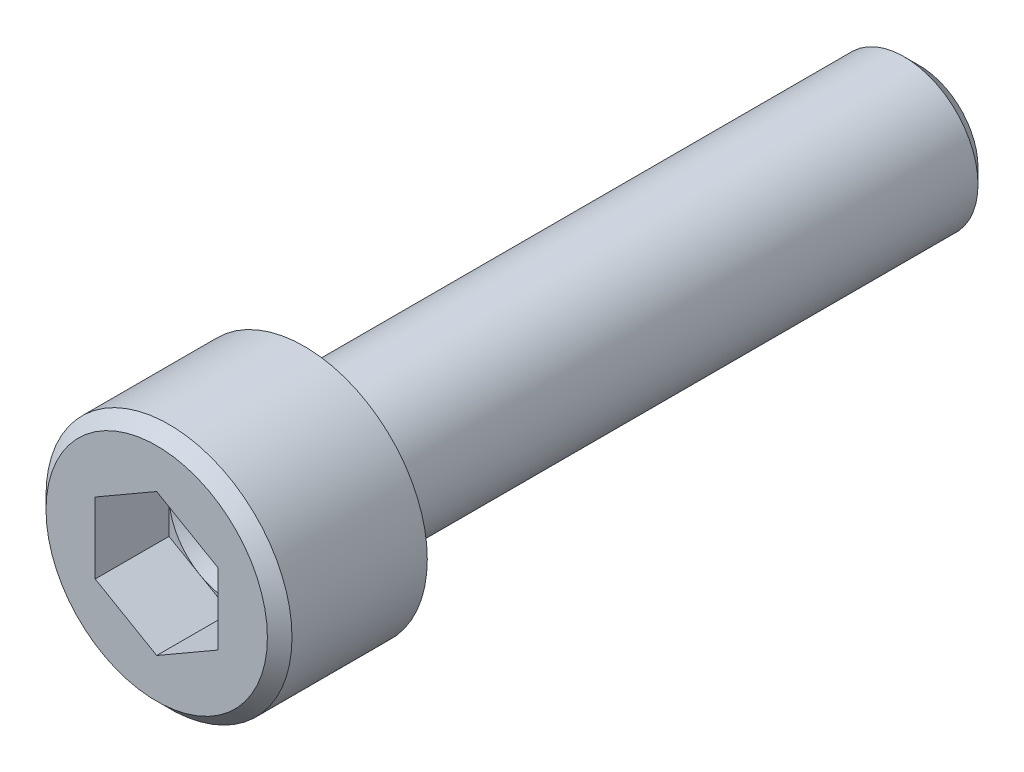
ISO-10303-21;
HEADER;
FILE_DESCRIPTION(('STEP AP214'),'2;1');
FILE_NAME('part.step','',(''),(''),'','','');
FILE_SCHEMA(('AUTOMOTIVE_DESIGN { 1 0 10303 214 1 1 1 1 }'));
ENDSEC;
DATA;
#1=APPLICATION_CONTEXT('core data for automotive mechanical design processes');
#2=APPLICATION_PROTOCOL_DEFINITION('international standard','automotive_design',2000,#1);
#3=PRODUCT_CONTEXT('',#1,'mechanical');
#4=PRODUCT('Part','Part','',(#3));
#5=PRODUCT_RELATED_PRODUCT_CATEGORY('part','',(#4));
#6=PRODUCT_DEFINITION_FORMATION('','',#4);
#7=PRODUCT_DEFINITION_CONTEXT('part definition',#1,'design');
#8=PRODUCT_DEFINITION('design','',#6,#7);
#9=PRODUCT_DEFINITION_SHAPE('','',#8);
#10=(LENGTH_UNIT() NAMED_UNIT(*) SI_UNIT(.MILLI.,.METRE.));
#11=(NAMED_UNIT(*) PLANE_ANGLE_UNIT() SI_UNIT($,.RADIAN.));
#12=(NAMED_UNIT(*) SI_UNIT($,.STERADIAN.) SOLID_ANGLE_UNIT());
#13=UNCERTAINTY_MEASURE_WITH_UNIT(LENGTH_MEASURE(1.E-05),#10,'distance_accuracy_value','');
#14=(GEOMETRIC_REPRESENTATION_CONTEXT(3) GLOBAL_UNCERTAINTY_ASSIGNED_CONTEXT((#13)) GLOBAL_UNIT_ASSIGNED_CONTEXT((#10,
#11,#12)) REPRESENTATION_CONTEXT('',''));
#15=CARTESIAN_POINT('',(0.,0.,0.));
#16=DIRECTION('',(0.,0.,1.));
#17=DIRECTION('',(1.,0.,0.));
#18=AXIS2_PLACEMENT_3D('',#15,#16,#17);
#19=CARTESIAN_POINT('',(0.,0.,3.));
#20=DIRECTION('',(0.,0.,1.));
#21=DIRECTION('',(1.,0.,0.));
#22=AXIS2_PLACEMENT_3D('',#19,#20,#21);
#23=PLANE('',#22);
#24=CARTESIAN_POINT('',(0.,0.,3.00000000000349));
#25=DIRECTION('',(0.,0.,1.));
#26=DIRECTION('',(0.,-1.,0.));
#27=AXIS2_PLACEMENT_3D('',#24,#25,#26);
#28=CIRCLE('',#27,2.49999999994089);
#29=CARTESIAN_POINT('',(2.49999999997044,0.,3.00000000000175));
#30=VERTEX_POINT('',#29);
#31=CARTESIAN_POINT('',(1.24999999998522,-2.1650635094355,3.00000000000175));
#32=VERTEX_POINT('',#31);
#33=EDGE_CURVE('E19',#30,#32,#28,.F.);
#34=ORIENTED_EDGE('',*,*,#33,.T.);
#35=DIRECTION('',(0.866025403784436,0.5,0.));
#36=VECTOR('',#35,1.);
#37=CARTESIAN_POINT('',(1.25,-2.1650635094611,3.));
#38=LINE('',#37,#36);
#39=CARTESIAN_POINT('',(2.5,-1.44337567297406,3.));
#40=VERTEX_POINT('',#39);
#41=EDGE_CURVE('E92',#32,#40,#38,.T.);
#42=ORIENTED_EDGE('',*,*,#41,.T.);
#43=DIRECTION('',(0.,1.,0.));
#44=VECTOR('',#43,1.);
#45=CARTESIAN_POINT('',(2.5,0.,3.));
#46=LINE('',#45,#44);
#47=EDGE_CURVE('E88',#40,#30,#46,.T.);
#48=ORIENTED_EDGE('',*,*,#47,.T.);
#49=EDGE_LOOP('',(#34,#42,#48));
#50=FACE_BOUND('',#49,.T.);
#51=ADVANCED_FACE('F16',(#50),#23,.T.);
#52=CARTESIAN_POINT('',(0.,0.,3.));
#53=DIRECTION('',(0.,0.,1.));
#54=DIRECTION('',(1.,0.,0.));
#55=AXIS2_PLACEMENT_3D('',#52,#53,#54);
#56=PLANE('',#55);
#57=CARTESIAN_POINT('',(0.,0.,3.00000000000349));
#58=DIRECTION('',(0.,0.,1.));
#59=DIRECTION('',(0.,-1.,0.));
#60=AXIS2_PLACEMENT_3D('',#57,#58,#59);
#61=CIRCLE('',#60,2.49999999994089);
#62=CARTESIAN_POINT('',(-1.24999999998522,-2.1650635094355,3.00000000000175));
#63=VERTEX_POINT('',#62);
#64=EDGE_CURVE('E107',#32,#63,#61,.F.);
#65=ORIENTED_EDGE('',*,*,#64,.T.);
#66=DIRECTION('',(0.866025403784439,-0.5,0.));
#67=VECTOR('',#66,1.);
#68=CARTESIAN_POINT('',(-1.25,-2.1650635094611,3.));
#69=LINE('',#68,#67);
#70=CARTESIAN_POINT('',(0.,-2.88675134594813,3.));
#71=VERTEX_POINT('',#70);
#72=EDGE_CURVE('E157',#63,#71,#69,.T.);
#73=ORIENTED_EDGE('',*,*,#72,.T.);
#74=DIRECTION('',(0.866025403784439,0.5,0.));
#75=VECTOR('',#74,1.);
#76=CARTESIAN_POINT('',(0.,-2.88675134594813,3.));
#77=LINE('',#76,#75);
#78=EDGE_CURVE('E162',#71,#32,#77,.T.);
#79=ORIENTED_EDGE('',*,*,#78,.T.);
#80=EDGE_LOOP('',(#65,#73,#79));
#81=FACE_BOUND('',#80,.T.);
#82=ADVANCED_FACE('F216',(#81),#56,.T.);
#83=CARTESIAN_POINT('',(0.,0.,3.));
#84=DIRECTION('',(0.,0.,1.));
#85=DIRECTION('',(1.,0.,0.));
#86=AXIS2_PLACEMENT_3D('',#83,#84,#85);
#87=PLANE('',#86);
#88=CARTESIAN_POINT('',(0.,0.,3.00000000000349));
#89=DIRECTION('',(0.,0.,1.));
#90=DIRECTION('',(0.,-1.,0.));
#91=AXIS2_PLACEMENT_3D('',#88,#89,#90);
#92=CIRCLE('',#91,2.49999999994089);
#93=CARTESIAN_POINT('',(-2.49999999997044,0.,3.00000000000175));
#94=VERTEX_POINT('',#93);
#95=EDGE_CURVE('E213',#63,#94,#92,.F.);
#96=ORIENTED_EDGE('',*,*,#95,.T.);
#97=DIRECTION('',(0.,1.,0.));
#98=VECTOR('',#97,1.);
#99=CARTESIAN_POINT('',(-2.5,0.,3.));
#100=LINE('',#99,#98);
#101=CARTESIAN_POINT('',(-2.5,-1.44337567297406,3.));
#102=VERTEX_POINT('',#101);
#103=EDGE_CURVE('E147',#94,#102,#100,.F.);
#104=ORIENTED_EDGE('',*,*,#103,.T.);
#105=DIRECTION('',(0.866025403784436,-0.5,0.));
#106=VECTOR('',#105,1.);
#107=CARTESIAN_POINT('',(-2.5,-1.44337567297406,3.));
#108=LINE('',#107,#106);
#109=EDGE_CURVE('E152',#102,#63,#108,.T.);
#110=ORIENTED_EDGE('',*,*,#109,.T.);
#111=EDGE_LOOP('',(#96,#104,#110));
#112=FACE_BOUND('',#111,.T.);
#113=ADVANCED_FACE('F218',(#112),#87,.T.);
#114=CARTESIAN_POINT('',(0.,0.,3.));
#115=DIRECTION('',(0.,0.,1.));
#116=DIRECTION('',(1.,0.,0.));
#117=AXIS2_PLACEMENT_3D('',#114,#115,#116);
#118=PLANE('',#117);
#119=CARTESIAN_POINT('',(0.,0.,3.00000000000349));
#120=DIRECTION('',(0.,0.,1.));
#121=DIRECTION('',(0.,-1.,0.));
#122=AXIS2_PLACEMENT_3D('',#119,#120,#121);
#123=CIRCLE('',#122,2.49999999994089);
#124=CARTESIAN_POINT('',(-1.24999999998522,2.1650635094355,3.00000000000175));
#125=VERTEX_POINT('',#124);
#126=EDGE_CURVE('E210',#94,#125,#123,.F.);
#127=ORIENTED_EDGE('',*,*,#126,.T.);
#128=DIRECTION('',(-0.866025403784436,-0.5,0.));
#129=VECTOR('',#128,1.);
#130=CARTESIAN_POINT('',(-1.25,2.1650635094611,3.));
#131=LINE('',#130,#129);
#132=CARTESIAN_POINT('',(-2.5,1.44337567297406,3.));
#133=VERTEX_POINT('',#132);
#134=EDGE_CURVE('E137',#125,#133,#131,.T.);
#135=ORIENTED_EDGE('',*,*,#134,.T.);
#136=DIRECTION('',(0.,1.,0.));
#137=VECTOR('',#136,1.);
#138=CARTESIAN_POINT('',(-2.5,0.,3.));
#139=LINE('',#138,#137);
#140=EDGE_CURVE('E142',#133,#94,#139,.F.);
#141=ORIENTED_EDGE('',*,*,#140,.T.);
#142=EDGE_LOOP('',(#127,#135,#141));
#143=FACE_BOUND('',#142,.T.);
#144=ADVANCED_FACE('F221',(#143),#118,.T.);
#145=CARTESIAN_POINT('',(0.,0.,3.));
#146=DIRECTION('',(0.,0.,1.));
#147=DIRECTION('',(1.,0.,0.));
#148=AXIS2_PLACEMENT_3D('',#145,#146,#147);
#149=PLANE('',#148);
#150=CARTESIAN_POINT('',(0.,0.,3.00000000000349));
#151=DIRECTION('',(0.,0.,1.));
#152=DIRECTION('',(0.,-1.,0.));
#153=AXIS2_PLACEMENT_3D('',#150,#151,#152);
#154=CIRCLE('',#153,2.49999999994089);
#155=CARTESIAN_POINT('',(1.24999999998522,2.1650635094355,3.00000000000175));
#156=VERTEX_POINT('',#155);
#157=EDGE_CURVE('E207',#125,#156,#154,.F.);
#158=ORIENTED_EDGE('',*,*,#157,.T.);
#159=DIRECTION('',(-0.866025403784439,0.5,0.));
#160=VECTOR('',#159,1.);
#161=CARTESIAN_POINT('',(1.25,2.1650635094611,3.));
#162=LINE('',#161,#160);
#163=CARTESIAN_POINT('',(0.,2.88675134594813,3.));
#164=VERTEX_POINT('',#163);
#165=EDGE_CURVE('E108',#156,#164,#162,.T.);
#166=ORIENTED_EDGE('',*,*,#165,.T.);
#167=DIRECTION('',(-0.866025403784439,-0.5,0.));
#168=VECTOR('',#167,1.);
#169=CARTESIAN_POINT('',(0.,2.88675134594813,3.));
#170=LINE('',#169,#168);
#171=EDGE_CURVE('E132',#164,#125,#170,.T.);
#172=ORIENTED_EDGE('',*,*,#171,.T.);
#173=EDGE_LOOP('',(#158,#166,#172));
#174=FACE_BOUND('',#173,.T.);
#175=ADVANCED_FACE('F223',(#174),#149,.T.);
#176=CARTESIAN_POINT('',(0.,0.,2.99999999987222));
#177=DIRECTION('',(0.,0.,1.));
#178=DIRECTION('',(0.,-1.,0.));
#179=AXIS2_PLACEMENT_3D('',#176,#177,#178);
#180=CONICAL_SURFACE('',#179,2.49999999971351,1.04719755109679);
#181=CARTESIAN_POINT('',(0.,5.6843418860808E-11,1.55662432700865));
#182=VERTEX_POINT('',#181);
#183=VERTEX_LOOP('',#182);
#184=FACE_BOUND('',#183,.T.);
#185=ORIENTED_EDGE('',*,*,#157,.F.);
#186=ORIENTED_EDGE('',*,*,#126,.F.);
#187=ORIENTED_EDGE('',*,*,#95,.F.);
#188=ORIENTED_EDGE('',*,*,#64,.F.);
#189=ORIENTED_EDGE('',*,*,#33,.F.);
#190=CARTESIAN_POINT('',(0.,0.,3.00000000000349));
#191=DIRECTION('',(0.,0.,1.));
#192=DIRECTION('',(0.,-1.,0.));
#193=AXIS2_PLACEMENT_3D('',#190,#191,#192);
#194=CIRCLE('',#193,2.49999999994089);
#195=EDGE_CURVE('E103',#156,#30,#194,.F.);
#196=ORIENTED_EDGE('',*,*,#195,.F.);
#197=EDGE_LOOP('',(#185,#186,#187,#188,#189,#196));
#198=FACE_BOUND('',#197,.T.);
#199=ADVANCED_FACE('F102',(#184,#198),#180,.F.);
#200=CARTESIAN_POINT('',(0.,0.,3.));
#201=DIRECTION('',(0.,0.,1.));
#202=DIRECTION('',(1.,0.,0.));
#203=AXIS2_PLACEMENT_3D('',#200,#201,#202);
#204=PLANE('',#203);
#205=ORIENTED_EDGE('',*,*,#195,.T.);
#206=DIRECTION('',(0.,1.,0.));
#207=VECTOR('',#206,1.);
#208=CARTESIAN_POINT('',(2.5,-1.44337567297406,3.));
#209=LINE('',#208,#207);
#210=CARTESIAN_POINT('',(2.5,1.44337567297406,3.));
#211=VERTEX_POINT('',#210);
#212=EDGE_CURVE('E112',#30,#211,#209,.T.);
#213=ORIENTED_EDGE('',*,*,#212,.T.);
#214=DIRECTION('',(-0.866025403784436,0.5,0.));
#215=VECTOR('',#214,1.);
#216=CARTESIAN_POINT('',(2.5,1.44337567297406,3.));
#217=LINE('',#216,#215);
#218=EDGE_CURVE('E114',#211,#156,#217,.T.);
#219=ORIENTED_EDGE('',*,*,#218,.T.);
#220=EDGE_LOOP('',(#205,#213,#219));
#221=FACE_BOUND('',#220,.T.);
#222=ADVANCED_FACE('F111',(#221),#204,.T.);
#223=CARTESIAN_POINT('',(2.5,-1.44337567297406,3.));
#224=DIRECTION('',(1.,0.,0.));
#225=DIRECTION('',(0.,0.,-1.));
#226=AXIS2_PLACEMENT_3D('',#223,#224,#225);
#227=PLANE('',#226);
#228=DIRECTION('',(0.,0.,1.));
#229=VECTOR('',#228,1.);
#230=CARTESIAN_POINT('',(2.5,1.44337567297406,3.));
#231=LINE('',#230,#229);
#232=CARTESIAN_POINT('',(2.5,1.44337567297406,6.));
#233=VERTEX_POINT('',#232);
#234=EDGE_CURVE('E118',#233,#211,#231,.F.);
#235=ORIENTED_EDGE('',*,*,#234,.T.);
#236=ORIENTED_EDGE('',*,*,#212,.F.);
#237=ORIENTED_EDGE('',*,*,#47,.F.);
#238=DIRECTION('',(0.,0.,1.));
#239=VECTOR('',#238,1.);
#240=CARTESIAN_POINT('',(2.5,-1.44337567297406,3.));
#241=LINE('',#240,#239);
#242=CARTESIAN_POINT('',(2.5,-1.44337567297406,6.));
#243=VERTEX_POINT('',#242);
#244=EDGE_CURVE('E189',#40,#243,#241,.T.);
#245=ORIENTED_EDGE('',*,*,#244,.T.);
#246=DIRECTION('',(0.,1.,0.));
#247=VECTOR('',#246,1.);
#248=CARTESIAN_POINT('',(2.5,0.,6.));
#249=LINE('',#248,#247);
#250=EDGE_CURVE('E193',#243,#233,#249,.T.);
#251=ORIENTED_EDGE('',*,*,#250,.T.);
#252=EDGE_LOOP('',(#235,#236,#237,#245,#251));
#253=FACE_BOUND('',#252,.T.);
#254=ADVANCED_FACE('F116',(#253),#227,.F.);
#255=CARTESIAN_POINT('',(2.5,1.44337567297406,3.));
#256=DIRECTION('',(0.5,0.866025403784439,0.));
#257=DIRECTION('',(-0.866025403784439,0.5,0.));
#258=AXIS2_PLACEMENT_3D('',#255,#256,#257);
#259=PLANE('',#258);
#260=DIRECTION('',(0.,0.,1.));
#261=VECTOR('',#260,1.);
#262=CARTESIAN_POINT('',(0.,2.88675134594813,3.));
#263=LINE('',#262,#261);
#264=CARTESIAN_POINT('',(0.,2.88675134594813,6.));
#265=VERTEX_POINT('',#264);
#266=EDGE_CURVE('E120',#265,#164,#263,.F.);
#267=ORIENTED_EDGE('',*,*,#266,.T.);
#268=ORIENTED_EDGE('',*,*,#165,.F.);
#269=ORIENTED_EDGE('',*,*,#218,.F.);
#270=ORIENTED_EDGE('',*,*,#234,.F.);
#271=DIRECTION('',(-0.866025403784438,0.5,0.));
#272=VECTOR('',#271,1.);
#273=CARTESIAN_POINT('',(2.5,1.44337567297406,6.));
#274=LINE('',#273,#272);
#275=EDGE_CURVE('E231',#233,#265,#274,.T.);
#276=ORIENTED_EDGE('',*,*,#275,.T.);
#277=EDGE_LOOP('',(#267,#268,#269,#270,#276));
#278=FACE_BOUND('',#277,.T.);
#279=ADVANCED_FACE('F229',(#278),#259,.F.);
#280=CARTESIAN_POINT('',(0.,2.88675134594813,3.));
#281=DIRECTION('',(-0.5,0.866025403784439,0.));
#282=DIRECTION('',(-0.866025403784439,-0.5,0.));
#283=AXIS2_PLACEMENT_3D('',#280,#281,#282);
#284=PLANE('',#283);
#285=DIRECTION('',(0.,0.,1.));
#286=VECTOR('',#285,1.);
#287=CARTESIAN_POINT('',(-2.5,1.44337567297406,3.));
#288=LINE('',#287,#286);
#289=CARTESIAN_POINT('',(-2.5,1.44337567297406,6.));
#290=VERTEX_POINT('',#289);
#291=EDGE_CURVE('E175',#290,#133,#288,.F.);
#292=ORIENTED_EDGE('',*,*,#291,.T.);
#293=ORIENTED_EDGE('',*,*,#134,.F.);
#294=ORIENTED_EDGE('',*,*,#171,.F.);
#295=ORIENTED_EDGE('',*,*,#266,.F.);
#296=DIRECTION('',(-0.866025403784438,-0.5,0.));
#297=VECTOR('',#296,1.);
#298=CARTESIAN_POINT('',(0.,2.88675134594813,6.));
#299=LINE('',#298,#297);
#300=EDGE_CURVE('E234',#265,#290,#299,.T.);
#301=ORIENTED_EDGE('',*,*,#300,.T.);
#302=EDGE_LOOP('',(#292,#293,#294,#295,#301));
#303=FACE_BOUND('',#302,.T.);
#304=ADVANCED_FACE('F226',(#303),#284,.F.);
#305=CARTESIAN_POINT('',(-2.5,1.44337567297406,3.));
#306=DIRECTION('',(-1.,0.,0.));
#307=DIRECTION('',(0.,0.,1.));
#308=AXIS2_PLACEMENT_3D('',#305,#306,#307);
#309=PLANE('',#308);
#310=DIRECTION('',(0.,0.,1.));
#311=VECTOR('',#310,1.);
#312=CARTESIAN_POINT('',(-2.5,-1.44337567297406,3.));
#313=LINE('',#312,#311);
#314=CARTESIAN_POINT('',(-2.5,-1.44337567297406,6.));
#315=VERTEX_POINT('',#314);
#316=EDGE_CURVE('E180',#315,#102,#313,.F.);
#317=ORIENTED_EDGE('',*,*,#316,.T.);
#318=ORIENTED_EDGE('',*,*,#103,.F.);
#319=ORIENTED_EDGE('',*,*,#140,.F.);
#320=ORIENTED_EDGE('',*,*,#291,.F.);
#321=DIRECTION('',(0.,1.,0.));
#322=VECTOR('',#321,1.);
#323=CARTESIAN_POINT('',(-2.5,0.,6.));
#324=LINE('',#323,#322);
#325=EDGE_CURVE('E236',#290,#315,#324,.F.);
#326=ORIENTED_EDGE('',*,*,#325,.T.);
#327=EDGE_LOOP('',(#317,#318,#319,#320,#326));
#328=FACE_BOUND('',#327,.T.);
#329=ADVANCED_FACE('F349',(#328),#309,.F.);
#330=CARTESIAN_POINT('',(-2.5,-1.44337567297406,3.));
#331=DIRECTION('',(-0.5,-0.866025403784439,0.));
#332=DIRECTION('',(0.866025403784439,-0.5,0.));
#333=AXIS2_PLACEMENT_3D('',#330,#331,#332);
#334=PLANE('',#333);
#335=DIRECTION('',(0.,0.,1.));
#336=VECTOR('',#335,1.);
#337=CARTESIAN_POINT('',(0.,-2.88675134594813,3.));
#338=LINE('',#337,#336);
#339=CARTESIAN_POINT('',(0.,-2.88675134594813,6.));
#340=VERTEX_POINT('',#339);
#341=EDGE_CURVE('E185',#340,#71,#338,.F.);
#342=ORIENTED_EDGE('',*,*,#341,.T.);
#343=ORIENTED_EDGE('',*,*,#72,.F.);
#344=ORIENTED_EDGE('',*,*,#109,.F.);
#345=ORIENTED_EDGE('',*,*,#316,.F.);
#346=DIRECTION('',(0.866025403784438,-0.5,0.));
#347=VECTOR('',#346,1.);
#348=CARTESIAN_POINT('',(-2.5,-1.44337567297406,6.));
#349=LINE('',#348,#347);
#350=EDGE_CURVE('E34',#315,#340,#349,.T.);
#351=ORIENTED_EDGE('',*,*,#350,.T.);
#352=EDGE_LOOP('',(#342,#343,#344,#345,#351));
#353=FACE_BOUND('',#352,.T.);
#354=ADVANCED_FACE('F340',(#353),#334,.F.);
#355=CARTESIAN_POINT('',(0.,-2.88675134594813,3.));
#356=DIRECTION('',(0.5,-0.866025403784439,0.));
#357=DIRECTION('',(0.866025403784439,0.5,0.));
#358=AXIS2_PLACEMENT_3D('',#355,#356,#357);
#359=PLANE('',#358);
#360=ORIENTED_EDGE('',*,*,#244,.F.);
#361=ORIENTED_EDGE('',*,*,#41,.F.);
#362=ORIENTED_EDGE('',*,*,#78,.F.);
#363=ORIENTED_EDGE('',*,*,#341,.F.);
#364=DIRECTION('',(0.866025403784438,0.5,0.));
#365=VECTOR('',#364,1.);
#366=CARTESIAN_POINT('',(0.,-2.88675134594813,6.));
#367=LINE('',#366,#365);
#368=EDGE_CURVE('E205',#340,#243,#367,.T.);
#369=ORIENTED_EDGE('',*,*,#368,.T.);
#370=EDGE_LOOP('',(#360,#361,#362,#363,#369));
#371=FACE_BOUND('',#370,.T.);
#372=ADVANCED_FACE('F333',(#371),#359,.F.);
#373=CARTESIAN_POINT('',(0.,0.,6.));
#374=DIRECTION('',(0.,0.,-1.));
#375=DIRECTION('',(-1.,0.,0.));
#376=AXIS2_PLACEMENT_3D('',#373,#374,#375);
#377=PLANE('',#376);
#378=ORIENTED_EDGE('',*,*,#350,.F.);
#379=ORIENTED_EDGE('',*,*,#325,.F.);
#380=ORIENTED_EDGE('',*,*,#300,.F.);
#381=ORIENTED_EDGE('',*,*,#275,.F.);
#382=ORIENTED_EDGE('',*,*,#250,.F.);
#383=ORIENTED_EDGE('',*,*,#368,.F.);
#384=EDGE_LOOP('',(#378,#379,#380,#381,#382,#383));
#385=FACE_BOUND('',#384,.T.);
#386=CARTESIAN_POINT('',(0.,0.,5.99999999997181));
#387=DIRECTION('',(0.,0.,-1.));
#388=DIRECTION('',(-1.,0.,0.));
#389=AXIS2_PLACEMENT_3D('',#386,#387,#388);
#390=CIRCLE('',#389,4.49999999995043);
#391=CARTESIAN_POINT('',(-4.49999999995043,0.,5.99999999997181));
#392=VERTEX_POINT('',#391);
#393=EDGE_CURVE('E203',#392,#392,#390,.T.);
#394=ORIENTED_EDGE('',*,*,#393,.F.);
#395=EDGE_LOOP('',(#394));
#396=FACE_BOUND('',#395,.T.);
#397=ADVANCED_FACE('F275',(#385,#396),#377,.F.);
#398=CARTESIAN_POINT('',(0.,0.,5.49999999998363));
#399=DIRECTION('',(0.,0.,-1.));
#400=DIRECTION('',(-1.,0.,0.));
#401=AXIS2_PLACEMENT_3D('',#398,#399,#400);
#402=CONICAL_SURFACE('',#401,4.99999999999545,0.785398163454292);
#403=ORIENTED_EDGE('',*,*,#393,.T.);
#404=EDGE_LOOP('',(#403));
#405=FACE_BOUND('',#404,.T.);
#406=CARTESIAN_POINT('',(0.,0.,5.5));
#407=DIRECTION('',(0.,0.,1.));
#408=DIRECTION('',(1.,0.,0.));
#409=AXIS2_PLACEMENT_3D('',#406,#407,#408);
#410=CIRCLE('',#409,5.);
#411=CARTESIAN_POINT('',(5.,0.,5.5));
#412=VERTEX_POINT('',#411);
#413=EDGE_CURVE('E202',#412,#412,#410,.F.);
#414=ORIENTED_EDGE('',*,*,#413,.F.);
#415=EDGE_LOOP('',(#414));
#416=FACE_BOUND('',#415,.T.);
#417=ADVANCED_FACE('F265',(#405,#416),#402,.T.);
#418=CARTESIAN_POINT('',(0.,2.3865,-25.));
#419=DIRECTION('',(0.,0.,1.));
#420=DIRECTION('',(1.,0.,0.));
#421=AXIS2_PLACEMENT_3D('',#418,#419,#420);
#422=PLANE('',#421);
#423=CARTESIAN_POINT('',(0.,0.,-24.9999999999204));
#424=DIRECTION('',(0.,0.,1.));
#425=DIRECTION('',(1.,0.,0.));
#426=AXIS2_PLACEMENT_3D('',#423,#424,#425);
#427=CIRCLE('',#426,2.38650000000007);
#428=CARTESIAN_POINT('',(2.38650000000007,0.,-24.9999999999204));
#429=VERTEX_POINT('',#428);
#430=EDGE_CURVE('E199',#429,#429,#427,.T.);
#431=ORIENTED_EDGE('',*,*,#430,.F.);
#432=EDGE_LOOP('',(#431));
#433=FACE_BOUND('',#432,.T.);
#434=ADVANCED_FACE('F263',(#433),#422,.F.);
#435=CARTESIAN_POINT('',(0.,0.,0.));
#436=DIRECTION('',(0.,0.,1.));
#437=DIRECTION('',(1.,0.,0.));
#438=AXIS2_PLACEMENT_3D('',#435,#436,#437);
#439=CYLINDRICAL_SURFACE('',#438,5.);
#440=ORIENTED_EDGE('',*,*,#413,.T.);
#441=EDGE_LOOP('',(#440));
#442=FACE_BOUND('',#441,.T.);
#443=CARTESIAN_POINT('',(0.,0.,0.));
#444=DIRECTION('',(0.,0.,1.));
#445=DIRECTION('',(1.,0.,0.));
#446=AXIS2_PLACEMENT_3D('',#443,#444,#445);
#447=CIRCLE('',#446,5.);
#448=CARTESIAN_POINT('',(5.,0.,0.));
#449=VERTEX_POINT('',#448);
#450=EDGE_CURVE('E196',#449,#449,#447,.T.);
#451=ORIENTED_EDGE('',*,*,#450,.T.);
#452=EDGE_LOOP('',(#451));
#453=FACE_BOUND('',#452,.T.);
#454=ADVANCED_FACE('F259',(#442,#453),#439,.T.);
#455=CARTESIAN_POINT('',(0.,0.,-24.3864999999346));
#456=DIRECTION('',(0.,0.,1.));
#457=DIRECTION('',(1.,0.,0.));
#458=AXIS2_PLACEMENT_3D('',#455,#456,#457);
#459=CONICAL_SURFACE('',#458,2.99999999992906,0.785398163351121);
#460=CARTESIAN_POINT('',(0.,0.,-24.3865));
#461=DIRECTION('',(0.,0.,1.));
#462=DIRECTION('',(1.,0.,0.));
#463=AXIS2_PLACEMENT_3D('',#460,#461,#462);
#464=CIRCLE('',#463,3.);
#465=CARTESIAN_POINT('',(3.,0.,-24.3865));
#466=VERTEX_POINT('',#465);
#467=EDGE_CURVE('E25',#466,#466,#464,.T.);
#468=ORIENTED_EDGE('',*,*,#467,.F.);
#469=EDGE_LOOP('',(#468));
#470=FACE_BOUND('',#469,.T.);
#471=ORIENTED_EDGE('',*,*,#430,.T.);
#472=EDGE_LOOP('',(#471));
#473=FACE_BOUND('',#472,.T.);
#474=ADVANCED_FACE('F255',(#470,#473),#459,.T.);
#475=CARTESIAN_POINT('',(0.,5.,0.));
#476=DIRECTION('',(0.,0.,1.));
#477=DIRECTION('',(1.,0.,0.));
#478=AXIS2_PLACEMENT_3D('',#475,#476,#477);
#479=PLANE('',#478);
#480=ORIENTED_EDGE('',*,*,#450,.F.);
#481=EDGE_LOOP('',(#480));
#482=FACE_BOUND('',#481,.T.);
#483=CARTESIAN_POINT('',(0.,0.,0.));
#484=DIRECTION('',(0.,0.,1.));
#485=DIRECTION('',(1.,0.,0.));
#486=AXIS2_PLACEMENT_3D('',#483,#484,#485);
#487=CIRCLE('',#486,3.);
#488=CARTESIAN_POINT('',(3.,0.,0.));
#489=VERTEX_POINT('',#488);
#490=EDGE_CURVE('E11',#489,#489,#487,.F.);
#491=ORIENTED_EDGE('',*,*,#490,.F.);
#492=EDGE_LOOP('',(#491));
#493=FACE_BOUND('',#492,.T.);
#494=ADVANCED_FACE('F258',(#482,#493),#479,.F.);
#495=CARTESIAN_POINT('',(0.,0.,-25.));
#496=DIRECTION('',(0.,0.,1.));
#497=DIRECTION('',(1.,0.,0.));
#498=AXIS2_PLACEMENT_3D('',#495,#496,#497);
#499=CYLINDRICAL_SURFACE('',#498,3.);
#500=ORIENTED_EDGE('',*,*,#490,.T.);
#501=EDGE_LOOP('',(#500));
#502=FACE_BOUND('',#501,.T.);
#503=ORIENTED_EDGE('',*,*,#467,.T.);
#504=EDGE_LOOP('',(#503));
#505=FACE_BOUND('',#504,.T.);
#506=ADVANCED_FACE('F253',(#502,#505),#499,.T.);
#507=CLOSED_SHELL('',(#51,#82,#113,#144,#175,#199,#222,#254,#279,#304,#329,#354,#372,#397,#417,
#434,#454,#474,#494,#506));
#508=MANIFOLD_SOLID_BREP('B1',#507);
#509=ADVANCED_BREP_SHAPE_REPRESENTATION('',(#18,#508),#14);
#510=SHAPE_DEFINITION_REPRESENTATION(#9,#509);
ENDSEC;
END-ISO-10303-21;
